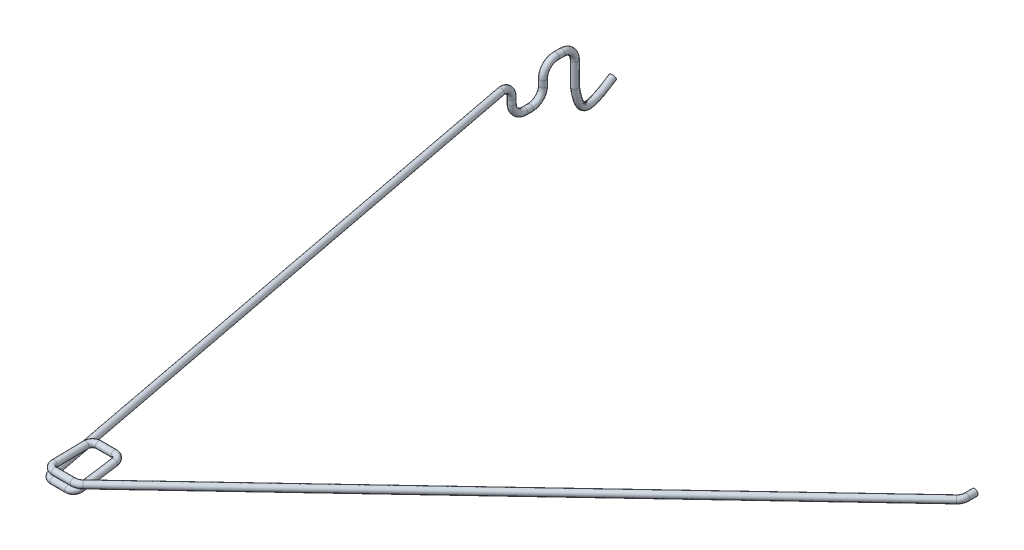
ISO-10303-21;
HEADER;
FILE_DESCRIPTION(('STEP AP214'),'2;1');
FILE_NAME('part.step','',(''),(''),'','','');
FILE_SCHEMA(('AUTOMOTIVE_DESIGN { 1 0 10303 214 1 1 1 1 }'));
ENDSEC;
DATA;
#1=APPLICATION_CONTEXT('core data for automotive mechanical design processes');
#2=APPLICATION_PROTOCOL_DEFINITION('international standard','automotive_design',2000,#1);
#3=PRODUCT_CONTEXT('',#1,'mechanical');
#4=PRODUCT('Part','Part','',(#3));
#5=PRODUCT_RELATED_PRODUCT_CATEGORY('part','',(#4));
#6=PRODUCT_DEFINITION_FORMATION('','',#4);
#7=PRODUCT_DEFINITION_CONTEXT('part definition',#1,'design');
#8=PRODUCT_DEFINITION('design','',#6,#7);
#9=PRODUCT_DEFINITION_SHAPE('','',#8);
#10=(LENGTH_UNIT() NAMED_UNIT(*) SI_UNIT(.MILLI.,.METRE.));
#11=(NAMED_UNIT(*) PLANE_ANGLE_UNIT() SI_UNIT($,.RADIAN.));
#12=(NAMED_UNIT(*) SI_UNIT($,.STERADIAN.) SOLID_ANGLE_UNIT());
#13=UNCERTAINTY_MEASURE_WITH_UNIT(LENGTH_MEASURE(1.E-05),#10,'distance_accuracy_value','');
#14=(GEOMETRIC_REPRESENTATION_CONTEXT(3) GLOBAL_UNCERTAINTY_ASSIGNED_CONTEXT((#13)) GLOBAL_UNIT_ASSIGNED_CONTEXT((#10,
#11,#12)) REPRESENTATION_CONTEXT('',''));
#15=CARTESIAN_POINT('',(0.,0.,0.));
#16=DIRECTION('',(0.,0.,1.));
#17=DIRECTION('',(1.,0.,0.));
#18=AXIS2_PLACEMENT_3D('',#15,#16,#17);
#19=CARTESIAN_POINT('',(-264.839690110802,36.7880776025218,54.3321516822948));
#20=DIRECTION('',(0.,-1.,0.));
#21=DIRECTION('',(0.,0.,-1.));
#22=AXIS2_PLACEMENT_3D('',#19,#20,#21);
#23=CYLINDRICAL_SURFACE('',#22,0.999999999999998);
#24=CARTESIAN_POINT('',(-264.839690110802,36.7880776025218,54.3321516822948));
#25=DIRECTION('',(0.,-1.,0.));
#26=DIRECTION('',(-0.921185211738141,0.,0.389124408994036));
#27=AXIS2_PLACEMENT_3D('',#24,#25,#26);
#28=CIRCLE('',#27,0.999999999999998);
#29=CARTESIAN_POINT('',(-264.839690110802,36.7880776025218,53.3321516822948));
#30=VERTEX_POINT('',#29);
#31=EDGE_CURVE('E11',#30,#30,#28,.T.);
#32=ORIENTED_EDGE('',*,*,#31,.T.);
#33=EDGE_LOOP('',(#32));
#34=FACE_BOUND('',#33,.T.);
#35=CARTESIAN_POINT('',(-265.00234133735,29.5658940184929,55.3188353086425));
#36=CARTESIAN_POINT('',(-263.028974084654,29.5658940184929,55.6441377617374));
#37=CARTESIAN_POINT('',(-262.70367163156,29.7388210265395,53.670770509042));
#38=CARTESIAN_POINT('',(-264.677038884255,29.7388210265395,53.3454680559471));
#39=CARTESIAN_POINT('',(-266.65040613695,29.7388210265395,53.0201656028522));
#40=CARTESIAN_POINT('',(-266.975708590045,29.5658940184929,54.9935328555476));
#41=CARTESIAN_POINT('',(-265.00234133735,29.5658940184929,55.3188353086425));
#42=(BOUNDED_CURVE() B_SPLINE_CURVE(3,(#35,#36,#37,#38,#39,#40,#41),.UNSPECIFIED.,.T.,
.F.) B_SPLINE_CURVE_WITH_KNOTS((4,3,4),(0.,0.5,1.),
.UNSPECIFIED.) CURVE() GEOMETRIC_REPRESENTATION_ITEM() RATIONAL_B_SPLINE_CURVE((1.,
0.333333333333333,0.333333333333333,1.,0.333333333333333,0.333333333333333,1.)) REPRESENTATION_ITEM(''));
#43=CARTESIAN_POINT('',(-265.00234133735,29.5658940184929,55.3188353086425));
#44=VERTEX_POINT('',#43);
#45=EDGE_CURVE('E110',#44,#44,#42,.T.);
#46=ORIENTED_EDGE('',*,*,#45,.T.);
#47=EDGE_LOOP('',(#46));
#48=FACE_BOUND('',#47,.T.);
#49=ADVANCED_FACE('F25',(#34,#48),#23,.T.);
#50=CARTESIAN_POINT('',(-264.839690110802,36.7880776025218,58.3321516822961));
#51=DIRECTION('',(-1.,0.,0.));
#52=DIRECTION('',(0.,0.,1.));
#53=AXIS2_PLACEMENT_3D('',#50,#51,#52);
#54=TOROIDAL_SURFACE('',#53,4.00000000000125,0.999999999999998);
#55=CARTESIAN_POINT('',(-264.839690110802,40.7880776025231,58.332151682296));
#56=DIRECTION('',(0.,0.,-1.));
#57=DIRECTION('',(-0.921185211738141,-0.389124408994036,0.));
#58=AXIS2_PLACEMENT_3D('',#55,#56,#57);
#59=CIRCLE('',#58,0.999999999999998);
#60=CARTESIAN_POINT('',(-264.839690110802,41.7880776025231,58.332151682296));
#61=VERTEX_POINT('',#60);
#62=EDGE_CURVE('E31',#61,#61,#59,.T.);
#63=CARTESIAN_POINT('',(-264.839690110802,36.7880776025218,58.3321516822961));
#64=DIRECTION('',(-1.,0.,0.));
#65=DIRECTION('',(0.,0.,1.));
#66=AXIS2_PLACEMENT_3D('',#63,#64,#65);
#67=CIRCLE('',#66,5.00000000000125);
#68=EDGE_CURVE('',#61,#30,#67,.T.);
#69=ORIENTED_EDGE('',*,*,#62,.T.);
#70=ORIENTED_EDGE('',*,*,#31,.F.);
#71=ORIENTED_EDGE('',*,*,#68,.T.);
#72=ORIENTED_EDGE('',*,*,#68,.F.);
#73=EDGE_LOOP('',(#69,#71,#70,#72));
#74=FACE_BOUND('',#73,.T.);
#75=ADVANCED_FACE('F137',(#74),#54,.T.);
#76=CARTESIAN_POINT('',(-264.839690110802,40.7880776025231,60.1683467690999));
#77=DIRECTION('',(0.,0.,-1.));
#78=DIRECTION('',(0.,1.,0.));
#79=AXIS2_PLACEMENT_3D('',#76,#77,#78);
#80=CYLINDRICAL_SURFACE('',#79,0.999999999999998);
#81=CARTESIAN_POINT('',(-264.839690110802,40.7880776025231,60.1683467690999));
#82=DIRECTION('',(0.,0.,-1.));
#83=DIRECTION('',(-0.921185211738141,-0.389124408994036,0.));
#84=AXIS2_PLACEMENT_3D('',#81,#82,#83);
#85=CIRCLE('',#84,0.999999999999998);
#86=CARTESIAN_POINT('',(-264.839690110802,41.7880776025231,60.1683467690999));
#87=VERTEX_POINT('',#86);
#88=EDGE_CURVE('E35',#87,#87,#85,.T.);
#89=ORIENTED_EDGE('',*,*,#88,.T.);
#90=EDGE_LOOP('',(#89));
#91=FACE_BOUND('',#90,.T.);
#92=ORIENTED_EDGE('',*,*,#62,.F.);
#93=EDGE_LOOP('',(#92));
#94=FACE_BOUND('',#93,.T.);
#95=ADVANCED_FACE('F141',(#91,#94),#80,.T.);
#96=CARTESIAN_POINT('',(-264.839690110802,36.7880776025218,60.1683467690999));
#97=DIRECTION('',(-1.,0.,0.));
#98=DIRECTION('',(0.,0.,1.));
#99=AXIS2_PLACEMENT_3D('',#96,#97,#98);
#100=TOROIDAL_SURFACE('',#99,4.00000000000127,0.999999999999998);
#101=CARTESIAN_POINT('',(-264.839690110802,36.7880776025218,64.1683467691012));
#102=DIRECTION('',(0.,1.,0.));
#103=DIRECTION('',(-0.921185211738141,0.,-0.389124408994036));
#104=AXIS2_PLACEMENT_3D('',#101,#102,#103);
#105=CIRCLE('',#104,0.999999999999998);
#106=CARTESIAN_POINT('',(-264.839690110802,36.7880776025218,65.1683467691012));
#107=VERTEX_POINT('',#106);
#108=EDGE_CURVE('E39',#107,#107,#105,.T.);
#109=CARTESIAN_POINT('',(-264.839690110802,36.7880776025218,60.1683467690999));
#110=DIRECTION('',(-1.,0.,0.));
#111=DIRECTION('',(0.,0.,1.));
#112=AXIS2_PLACEMENT_3D('',#109,#110,#111);
#113=CIRCLE('',#112,5.00000000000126);
#114=EDGE_CURVE('',#107,#87,#113,.T.);
#115=ORIENTED_EDGE('',*,*,#108,.T.);
#116=ORIENTED_EDGE('',*,*,#88,.F.);
#117=ORIENTED_EDGE('',*,*,#114,.T.);
#118=ORIENTED_EDGE('',*,*,#114,.F.);
#119=EDGE_LOOP('',(#115,#117,#116,#118));
#120=FACE_BOUND('',#119,.T.);
#121=ADVANCED_FACE('F145',(#120),#100,.T.);
#122=CARTESIAN_POINT('',(-264.839690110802,34.8914459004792,64.1683467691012));
#123=DIRECTION('',(0.,1.,0.));
#124=DIRECTION('',(0.,0.,1.));
#125=AXIS2_PLACEMENT_3D('',#122,#123,#124);
#126=CYLINDRICAL_SURFACE('',#125,0.999999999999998);
#127=CARTESIAN_POINT('',(-264.839690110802,34.8914459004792,64.1683467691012));
#128=DIRECTION('',(0.,1.,0.));
#129=DIRECTION('',(-0.921185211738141,0.,-0.389124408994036));
#130=AXIS2_PLACEMENT_3D('',#127,#128,#129);
#131=CIRCLE('',#130,0.999999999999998);
#132=CARTESIAN_POINT('',(-264.839690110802,34.8914459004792,63.1683467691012));
#133=VERTEX_POINT('',#132);
#134=EDGE_CURVE('E44',#133,#133,#131,.T.);
#135=ORIENTED_EDGE('',*,*,#134,.T.);
#136=EDGE_LOOP('',(#135));
#137=FACE_BOUND('',#136,.T.);
#138=ORIENTED_EDGE('',*,*,#108,.F.);
#139=EDGE_LOOP('',(#138));
#140=FACE_BOUND('',#139,.T.);
#141=ADVANCED_FACE('F152',(#137,#140),#126,.T.);
#142=CARTESIAN_POINT('',(-264.839690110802,34.8914459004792,68.1683467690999));
#143=DIRECTION('',(1.,0.,0.));
#144=DIRECTION('',(0.,0.,-1.));
#145=AXIS2_PLACEMENT_3D('',#142,#143,#144);
#146=TOROIDAL_SURFACE('',#145,3.99999999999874,0.999999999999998);
#147=CARTESIAN_POINT('',(-264.839690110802,30.8914459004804,68.1683467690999));
#148=DIRECTION('',(0.,0.,-1.));
#149=DIRECTION('',(-0.921185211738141,-0.389124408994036,0.));
#150=AXIS2_PLACEMENT_3D('',#147,#148,#149);
#151=CIRCLE('',#150,0.999999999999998);
#152=CARTESIAN_POINT('',(-264.839690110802,29.8914459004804,68.1683467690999));
#153=VERTEX_POINT('',#152);
#154=EDGE_CURVE('E47',#153,#153,#151,.T.);
#155=CARTESIAN_POINT('',(-264.839690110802,34.8914459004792,68.1683467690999));
#156=DIRECTION('',(1.,0.,0.));
#157=DIRECTION('',(0.,0.,-1.));
#158=AXIS2_PLACEMENT_3D('',#155,#156,#157);
#159=CIRCLE('',#158,4.99999999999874);
#160=EDGE_CURVE('',#153,#133,#159,.T.);
#161=ORIENTED_EDGE('',*,*,#154,.T.);
#162=ORIENTED_EDGE('',*,*,#134,.F.);
#163=ORIENTED_EDGE('',*,*,#160,.T.);
#164=ORIENTED_EDGE('',*,*,#160,.F.);
#165=EDGE_LOOP('',(#161,#163,#162,#164));
#166=FACE_BOUND('',#165,.T.);
#167=ADVANCED_FACE('F156',(#166),#146,.T.);
#168=CARTESIAN_POINT('',(-264.839690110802,30.8914459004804,69.86920921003));
#169=DIRECTION('',(0.,0.,-1.));
#170=DIRECTION('',(0.,1.,0.));
#171=AXIS2_PLACEMENT_3D('',#168,#169,#170);
#172=CYLINDRICAL_SURFACE('',#171,0.999999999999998);
#173=CARTESIAN_POINT('',(-264.839690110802,30.8914459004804,69.86920921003));
#174=DIRECTION('',(0.,0.,-1.));
#175=DIRECTION('',(-0.921185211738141,-0.389124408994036,0.));
#176=AXIS2_PLACEMENT_3D('',#173,#174,#175);
#177=CIRCLE('',#176,0.999999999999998);
#178=CARTESIAN_POINT('',(-264.839690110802,29.8914459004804,69.86920921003));
#179=VERTEX_POINT('',#178);
#180=EDGE_CURVE('E50',#179,#179,#177,.T.);
#181=ORIENTED_EDGE('',*,*,#180,.T.);
#182=EDGE_LOOP('',(#181));
#183=FACE_BOUND('',#182,.T.);
#184=ORIENTED_EDGE('',*,*,#154,.F.);
#185=EDGE_LOOP('',(#184));
#186=FACE_BOUND('',#185,.T.);
#187=ADVANCED_FACE('F160',(#183,#186),#172,.T.);
#188=CARTESIAN_POINT('',(-264.839690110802,34.8914459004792,69.8692092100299));
#189=DIRECTION('',(1.,0.,0.));
#190=DIRECTION('',(0.,0.,-1.));
#191=AXIS2_PLACEMENT_3D('',#188,#189,#190);
#192=TOROIDAL_SURFACE('',#191,3.99999999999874,0.999999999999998);
#193=CARTESIAN_POINT('',(-264.839690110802,34.8914459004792,73.8692092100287));
#194=DIRECTION('',(0.,-1.,0.));
#195=DIRECTION('',(-0.921185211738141,0.,0.389124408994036));
#196=AXIS2_PLACEMENT_3D('',#193,#194,#195);
#197=CIRCLE('',#196,0.999999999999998);
#198=CARTESIAN_POINT('',(-264.839690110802,34.8914459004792,74.8692092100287));
#199=VERTEX_POINT('',#198);
#200=EDGE_CURVE('E53',#199,#199,#197,.T.);
#201=CARTESIAN_POINT('',(-264.839690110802,34.8914459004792,69.8692092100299));
#202=DIRECTION('',(1.,0.,0.));
#203=DIRECTION('',(0.,0.,-1.));
#204=AXIS2_PLACEMENT_3D('',#201,#202,#203);
#205=CIRCLE('',#204,4.99999999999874);
#206=EDGE_CURVE('',#199,#179,#205,.T.);
#207=ORIENTED_EDGE('',*,*,#200,.T.);
#208=ORIENTED_EDGE('',*,*,#180,.F.);
#209=ORIENTED_EDGE('',*,*,#206,.T.);
#210=ORIENTED_EDGE('',*,*,#206,.F.);
#211=EDGE_LOOP('',(#207,#209,#208,#210));
#212=FACE_BOUND('',#211,.T.);
#213=ADVANCED_FACE('F164',(#212),#192,.T.);
#214=CARTESIAN_POINT('',(-264.839690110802,36.3958685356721,73.8692092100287));
#215=DIRECTION('',(0.,-1.,0.));
#216=DIRECTION('',(0.,0.,-1.));
#217=AXIS2_PLACEMENT_3D('',#214,#215,#216);
#218=CYLINDRICAL_SURFACE('',#217,0.999999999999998);
#219=CARTESIAN_POINT('',(-264.839690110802,36.3958685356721,73.8692092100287));
#220=DIRECTION('',(0.,-1.,0.));
#221=DIRECTION('',(-0.921185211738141,0.,0.389124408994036));
#222=AXIS2_PLACEMENT_3D('',#219,#220,#221);
#223=CIRCLE('',#222,0.999999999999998);
#224=CARTESIAN_POINT('',(-265.003293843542,36.3958685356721,72.8826830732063));
#225=VERTEX_POINT('',#224);
#226=EDGE_CURVE('E56',#225,#225,#223,.T.);
#227=ORIENTED_EDGE('',*,*,#226,.T.);
#228=EDGE_LOOP('',(#227));
#229=FACE_BOUND('',#228,.T.);
#230=ORIENTED_EDGE('',*,*,#200,.F.);
#231=EDGE_LOOP('',(#230));
#232=FACE_BOUND('',#231,.T.);
#233=ADVANCED_FACE('F168',(#229,#232),#218,.T.);
#234=CARTESIAN_POINT('',(-264.185275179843,36.3958685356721,77.8153137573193));
#235=DIRECTION('',(-0.986526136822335,0.,0.163603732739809));
#236=DIRECTION('',(0.163603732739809,0.,0.986526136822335));
#237=AXIS2_PLACEMENT_3D('',#234,#235,#236);
#238=TOROIDAL_SURFACE('',#237,4.00000000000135,0.999999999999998);
#239=CARTESIAN_POINT('',(-264.164783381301,40.3939070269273,77.9388787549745));
#240=DIRECTION('',(-0.163523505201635,0.0313131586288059,-0.986042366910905));
#241=DIRECTION('',(-0.960527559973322,-0.233057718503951,0.15189110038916));
#242=AXIS2_PLACEMENT_3D('',#239,#240,#241);
#243=CIRCLE('',#242,0.999999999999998);
#244=CARTESIAN_POINT('',(-264.159660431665,41.3934166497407,77.9697700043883));
#245=VERTEX_POINT('',#244);
#246=EDGE_CURVE('E59',#245,#245,#243,.T.);
#247=CARTESIAN_POINT('',(-264.185275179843,36.3958685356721,77.8153137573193));
#248=DIRECTION('',(-0.986526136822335,0.,0.163603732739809));
#249=DIRECTION('',(0.163603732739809,0.,0.986526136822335));
#250=AXIS2_PLACEMENT_3D('',#247,#248,#249);
#251=CIRCLE('',#250,5.00000000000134);
#252=EDGE_CURVE('',#245,#225,#251,.T.);
#253=ORIENTED_EDGE('',*,*,#246,.T.);
#254=ORIENTED_EDGE('',*,*,#226,.F.);
#255=ORIENTED_EDGE('',*,*,#252,.T.);
#256=ORIENTED_EDGE('',*,*,#252,.F.);
#257=EDGE_LOOP('',(#253,#255,#254,#256));
#258=FACE_BOUND('',#257,.T.);
#259=ADVANCED_FACE('F172',(#258),#238,.T.);
#260=CARTESIAN_POINT('',(-236.58079992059,35.1118428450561,244.269561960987));
#261=DIRECTION('',(-0.163523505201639,0.0313131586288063,-0.986042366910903));
#262=DIRECTION('',(-0.986526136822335,0.,0.163603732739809));
#263=AXIS2_PLACEMENT_3D('',#260,#261,#262);
#264=CYLINDRICAL_SURFACE('',#263,0.999999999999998);
#265=CARTESIAN_POINT('',(-236.58079992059,35.1118428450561,244.269561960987));
#266=DIRECTION('',(-0.163523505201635,0.0313131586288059,-0.986042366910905));
#267=DIRECTION('',(-0.960527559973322,-0.233057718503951,0.15189110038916));
#268=AXIS2_PLACEMENT_3D('',#265,#266,#267);
#269=CIRCLE('',#268,0.999999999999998);
#270=CARTESIAN_POINT('',(-237.567339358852,35.1066525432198,244.433003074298));
#271=VERTEX_POINT('',#270);
#272=EDGE_CURVE('E62',#271,#271,#269,.T.);
#273=ORIENTED_EDGE('',*,*,#272,.T.);
#274=EDGE_LOOP('',(#273));
#275=FACE_BOUND('',#274,.T.);
#276=ORIENTED_EDGE('',*,*,#246,.F.);
#277=EDGE_LOOP('',(#276));
#278=FACE_BOUND('',#277,.T.);
#279=ADVANCED_FACE('F176',(#275,#278),#264,.T.);
#280=CARTESIAN_POINT('',(-234.607721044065,35.1222234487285,243.942679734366));
#281=DIRECTION('',(0.,-0.999496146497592,-0.0317404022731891));
#282=DIRECTION('',(0.,0.0317404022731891,-0.999496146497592));
#283=AXIS2_PLACEMENT_3D('',#280,#281,#282);
#284=TOROIDAL_SURFACE('',#283,2.00000000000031,0.999999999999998);
#285=CARTESIAN_POINT('',(-234.607721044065,35.0587426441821,245.941672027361));
#286=DIRECTION('',(-1.,0.,0.));
#287=DIRECTION('',(0.,-0.258907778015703,0.965902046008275));
#288=AXIS2_PLACEMENT_3D('',#285,#286,#287);
#289=CIRCLE('',#288,0.999999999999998);
#290=CARTESIAN_POINT('',(-234.607721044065,35.0270022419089,246.941168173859));
#291=VERTEX_POINT('',#290);
#292=EDGE_CURVE('E65',#291,#291,#289,.T.);
#293=CARTESIAN_POINT('',(-234.607721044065,35.1222234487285,243.942679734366));
#294=DIRECTION('',(0.,-0.999496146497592,-0.0317404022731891));
#295=DIRECTION('',(0.,0.0317404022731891,-0.999496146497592));
#296=AXIS2_PLACEMENT_3D('',#293,#294,#295);
#297=CIRCLE('',#296,3.00000000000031);
#298=EDGE_CURVE('',#291,#271,#297,.T.);
#299=ORIENTED_EDGE('',*,*,#292,.T.);
#300=ORIENTED_EDGE('',*,*,#272,.F.);
#301=ORIENTED_EDGE('',*,*,#298,.T.);
#302=ORIENTED_EDGE('',*,*,#298,.F.);
#303=EDGE_LOOP('',(#299,#301,#300,#302));
#304=FACE_BOUND('',#303,.T.);
#305=ADVANCED_FACE('F180',(#304),#284,.T.);
#306=CARTESIAN_POINT('',(-230.075091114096,35.058742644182,245.941672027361));
#307=DIRECTION('',(-1.,0.,0.));
#308=DIRECTION('',(0.,-1.,0.));
#309=AXIS2_PLACEMENT_3D('',#306,#307,#308);
#310=CYLINDRICAL_SURFACE('',#309,0.999999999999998);
#311=CARTESIAN_POINT('',(-230.075091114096,35.058742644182,245.941672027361));
#312=DIRECTION('',(-1.,0.,0.));
#313=DIRECTION('',(0.,-0.258907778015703,0.965902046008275));
#314=AXIS2_PLACEMENT_3D('',#311,#312,#313);
#315=CIRCLE('',#314,0.999999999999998);
#316=CARTESIAN_POINT('',(-230.075091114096,34.9049249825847,246.929771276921));
#317=VERTEX_POINT('',#316);
#318=EDGE_CURVE('E68',#317,#317,#315,.T.);
#319=ORIENTED_EDGE('',*,*,#318,.T.);
#320=EDGE_LOOP('',(#319));
#321=FACE_BOUND('',#320,.T.);
#322=ORIENTED_EDGE('',*,*,#292,.F.);
#323=EDGE_LOOP('',(#322));
#324=FACE_BOUND('',#323,.T.);
#325=ADVANCED_FACE('F184',(#321,#324),#310,.T.);
#326=CARTESIAN_POINT('',(-230.075091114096,35.3663779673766,243.965473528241));
#327=DIRECTION('',(0.,-0.988099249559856,-0.153817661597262));
#328=DIRECTION('',(0.,0.153817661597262,-0.988099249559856));
#329=AXIS2_PLACEMENT_3D('',#326,#327,#328);
#330=TOROIDAL_SURFACE('',#329,2.00000000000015,0.999999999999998);
#331=CARTESIAN_POINT('',(-228.075094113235,35.3658452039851,243.968895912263));
#332=DIRECTION('',(-0.00173180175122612,-0.153817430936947,0.988097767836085));
#333=DIRECTION('',(0.994230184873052,-0.106242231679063,-0.0147962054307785));
#334=AXIS2_PLACEMENT_3D('',#331,#332,#333);
#335=CIRCLE('',#334,0.999999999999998);
#336=CARTESIAN_POINT('',(-227.075095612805,35.3655788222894,243.970607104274));
#337=VERTEX_POINT('',#336);
#338=EDGE_CURVE('E71',#337,#337,#335,.T.);
#339=CARTESIAN_POINT('',(-230.075091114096,35.3663779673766,243.965473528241));
#340=DIRECTION('',(0.,-0.988099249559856,-0.153817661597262));
#341=DIRECTION('',(0.,0.153817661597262,-0.988099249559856));
#342=AXIS2_PLACEMENT_3D('',#339,#340,#341);
#343=CIRCLE('',#342,3.00000000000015);
#344=EDGE_CURVE('',#337,#317,#343,.T.);
#345=ORIENTED_EDGE('',*,*,#338,.T.);
#346=ORIENTED_EDGE('',*,*,#318,.F.);
#347=ORIENTED_EDGE('',*,*,#344,.T.);
#348=ORIENTED_EDGE('',*,*,#344,.F.);
#349=EDGE_LOOP('',(#345,#347,#346,#348));
#350=FACE_BOUND('',#349,.T.);
#351=ADVANCED_FACE('F188',(#350),#330,.T.);
#352=CARTESIAN_POINT('',(-228.056892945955,36.9824602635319,233.584027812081));
#353=DIRECTION('',(-0.00173180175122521,-0.153817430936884,0.988097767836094));
#354=DIRECTION('',(0.,-0.988099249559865,-0.1538176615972));
#355=AXIS2_PLACEMENT_3D('',#352,#353,#354);
#356=CYLINDRICAL_SURFACE('',#355,0.999999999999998);
#357=CARTESIAN_POINT('',(-228.056892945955,36.9824602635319,233.584027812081));
#358=DIRECTION('',(-0.00173180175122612,-0.153817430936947,0.988097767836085));
#359=DIRECTION('',(0.994230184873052,-0.106242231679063,-0.0147962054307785));
#360=AXIS2_PLACEMENT_3D('',#357,#358,#359);
#361=CIRCLE('',#360,0.999999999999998);
#362=CARTESIAN_POINT('',(-227.056894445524,36.9821938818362,233.585739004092));
#363=VERTEX_POINT('',#362);
#364=EDGE_CURVE('E74',#363,#363,#361,.T.);
#365=ORIENTED_EDGE('',*,*,#364,.T.);
#366=EDGE_LOOP('',(#365));
#367=FACE_BOUND('',#366,.T.);
#368=ORIENTED_EDGE('',*,*,#338,.F.);
#369=EDGE_LOOP('',(#368));
#370=FACE_BOUND('',#369,.T.);
#371=ADVANCED_FACE('F192',(#367,#370),#356,.T.);
#372=CARTESIAN_POINT('',(-230.056889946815,36.9829930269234,233.580605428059));
#373=DIRECTION('',(0.,-0.988099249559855,-0.153817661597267));
#374=DIRECTION('',(0.,0.153817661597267,-0.988099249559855));
#375=AXIS2_PLACEMENT_3D('',#372,#373,#374);
#376=TOROIDAL_SURFACE('',#375,2.00000000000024,0.999999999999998);
#377=CARTESIAN_POINT('',(-230.056889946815,37.290628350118,231.604406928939));
#378=DIRECTION('',(1.,0.,0.));
#379=DIRECTION('',(0.,0.0469530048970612,-0.99889709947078));
#380=AXIS2_PLACEMENT_3D('',#377,#378,#379);
#381=CIRCLE('',#380,0.999999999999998);
#382=CARTESIAN_POINT('',(-230.056889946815,37.4444460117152,230.616307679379));
#383=VERTEX_POINT('',#382);
#384=EDGE_CURVE('E77',#383,#383,#381,.T.);
#385=CARTESIAN_POINT('',(-230.056889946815,36.9829930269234,233.580605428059));
#386=DIRECTION('',(0.,-0.988099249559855,-0.153817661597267));
#387=DIRECTION('',(0.,0.153817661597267,-0.988099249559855));
#388=AXIS2_PLACEMENT_3D('',#385,#386,#387);
#389=CIRCLE('',#388,3.00000000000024);
#390=EDGE_CURVE('',#383,#363,#389,.T.);
#391=ORIENTED_EDGE('',*,*,#384,.T.);
#392=ORIENTED_EDGE('',*,*,#364,.F.);
#393=ORIENTED_EDGE('',*,*,#390,.T.);
#394=ORIENTED_EDGE('',*,*,#390,.F.);
#395=EDGE_LOOP('',(#391,#393,#392,#394));
#396=FACE_BOUND('',#395,.T.);
#397=ADVANCED_FACE('F196',(#396),#376,.T.);
#398=CARTESIAN_POINT('',(-234.873906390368,37.2906283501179,231.604406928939));
#399=DIRECTION('',(1.,0.,0.));
#400=DIRECTION('',(0.,1.,0.));
#401=AXIS2_PLACEMENT_3D('',#398,#399,#400);
#402=CYLINDRICAL_SURFACE('',#401,0.999999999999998);
#403=CARTESIAN_POINT('',(-234.873906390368,37.2906283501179,231.604406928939));
#404=DIRECTION('',(1.,0.,0.));
#405=DIRECTION('',(0.,0.0469530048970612,-0.99889709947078));
#406=AXIS2_PLACEMENT_3D('',#403,#404,#405);
#407=CIRCLE('',#406,0.999999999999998);
#408=CARTESIAN_POINT('',(-234.873906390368,37.3094811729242,230.604584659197));
#409=VERTEX_POINT('',#408);
#410=EDGE_CURVE('E80',#409,#409,#407,.T.);
#411=ORIENTED_EDGE('',*,*,#410,.T.);
#412=EDGE_LOOP('',(#411));
#413=FACE_BOUND('',#412,.T.);
#414=ORIENTED_EDGE('',*,*,#384,.F.);
#415=EDGE_LOOP('',(#414));
#416=FACE_BOUND('',#415,.T.);
#417=ADVANCED_FACE('F200',(#413,#416),#402,.T.);
#418=CARTESIAN_POINT('',(-234.873906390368,37.2529227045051,233.604051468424));
#419=DIRECTION('',(0.,-0.999822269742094,-0.0188528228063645));
#420=DIRECTION('',(0.,0.0188528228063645,-0.999822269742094));
#421=AXIS2_PLACEMENT_3D('',#418,#419,#420);
#422=TOROIDAL_SURFACE('',#421,2.,0.999999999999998);
#423=CARTESIAN_POINT('',(-236.873906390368,37.2529227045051,233.604051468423));
#424=DIRECTION('',(0.,0.0188528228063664,-0.999822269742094));
#425=DIRECTION('',(-0.999604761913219,0.0281076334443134,0.000530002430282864));
#426=AXIS2_PLACEMENT_3D('',#423,#424,#425);
#427=CIRCLE('',#426,0.999999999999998);
#428=CARTESIAN_POINT('',(-237.873906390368,37.2529227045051,233.604051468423));
#429=VERTEX_POINT('',#428);
#430=EDGE_CURVE('E83',#429,#429,#427,.T.);
#431=CARTESIAN_POINT('',(-234.873906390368,37.2529227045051,233.604051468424));
#432=DIRECTION('',(0.,-0.999822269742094,-0.0188528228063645));
#433=DIRECTION('',(0.,0.0188528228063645,-0.999822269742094));
#434=AXIS2_PLACEMENT_3D('',#431,#432,#433);
#435=CIRCLE('',#434,3.);
#436=EDGE_CURVE('',#429,#409,#435,.T.);
#437=ORIENTED_EDGE('',*,*,#430,.T.);
#438=ORIENTED_EDGE('',*,*,#410,.F.);
#439=ORIENTED_EDGE('',*,*,#436,.T.);
#440=ORIENTED_EDGE('',*,*,#436,.F.);
#441=EDGE_LOOP('',(#437,#439,#438,#440));
#442=FACE_BOUND('',#441,.T.);
#443=ADVANCED_FACE('F204',(#442),#422,.T.);
#444=CARTESIAN_POINT('',(-236.873906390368,37.0703909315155,243.284263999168));
#445=DIRECTION('',(0.,0.0188528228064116,-0.999822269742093));
#446=DIRECTION('',(0.,0.999822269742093,0.0188528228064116));
#447=AXIS2_PLACEMENT_3D('',#444,#445,#446);
#448=CYLINDRICAL_SURFACE('',#447,0.999999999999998);
#449=CARTESIAN_POINT('',(-236.873906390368,37.0703909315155,243.284263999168));
#450=DIRECTION('',(0.,0.0188528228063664,-0.999822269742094));
#451=DIRECTION('',(-0.999604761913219,0.0281076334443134,0.000530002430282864));
#452=AXIS2_PLACEMENT_3D('',#449,#450,#451);
#453=CIRCLE('',#452,0.999999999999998);
#454=CARTESIAN_POINT('',(-237.873906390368,37.0703909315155,243.284263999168));
#455=VERTEX_POINT('',#454);
#456=EDGE_CURVE('E86',#455,#455,#453,.T.);
#457=ORIENTED_EDGE('',*,*,#456,.T.);
#458=EDGE_LOOP('',(#457));
#459=FACE_BOUND('',#458,.T.);
#460=ORIENTED_EDGE('',*,*,#430,.F.);
#461=EDGE_LOOP('',(#460));
#462=FACE_BOUND('',#461,.T.);
#463=ADVANCED_FACE('F208',(#459,#462),#448,.T.);
#464=CARTESIAN_POINT('',(-234.873906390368,37.0703909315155,243.284263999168));
#465=DIRECTION('',(0.,-0.999822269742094,-0.0188528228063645));
#466=DIRECTION('',(0.,0.0188528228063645,-0.999822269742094));
#467=AXIS2_PLACEMENT_3D('',#464,#465,#466);
#468=TOROIDAL_SURFACE('',#467,1.99999999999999,0.999999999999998);
#469=CARTESIAN_POINT('',(-234.873906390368,37.0326852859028,245.283908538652));
#470=DIRECTION('',(-1.,0.,0.));
#471=DIRECTION('',(0.,0.00926226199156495,0.999957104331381));
#472=AXIS2_PLACEMENT_3D('',#469,#470,#471);
#473=CIRCLE('',#472,0.999999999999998);
#474=CARTESIAN_POINT('',(-234.873906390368,37.0138324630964,246.283730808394));
#475=VERTEX_POINT('',#474);
#476=EDGE_CURVE('E89',#475,#475,#473,.T.);
#477=CARTESIAN_POINT('',(-234.873906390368,37.0703909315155,243.284263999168));
#478=DIRECTION('',(0.,-0.999822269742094,-0.0188528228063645));
#479=DIRECTION('',(0.,0.0188528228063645,-0.999822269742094));
#480=AXIS2_PLACEMENT_3D('',#477,#478,#479);
#481=CIRCLE('',#480,2.99999999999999);
#482=EDGE_CURVE('',#475,#455,#481,.T.);
#483=ORIENTED_EDGE('',*,*,#476,.T.);
#484=ORIENTED_EDGE('',*,*,#456,.F.);
#485=ORIENTED_EDGE('',*,*,#482,.T.);
#486=ORIENTED_EDGE('',*,*,#482,.F.);
#487=EDGE_LOOP('',(#483,#485,#484,#486));
#488=FACE_BOUND('',#487,.T.);
#489=ADVANCED_FACE('F212',(#488),#468,.T.);
#490=CARTESIAN_POINT('',(-229.053961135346,37.0326852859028,245.283908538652));
#491=DIRECTION('',(-1.,0.,0.));
#492=DIRECTION('',(0.,0.,1.));
#493=AXIS2_PLACEMENT_3D('',#490,#491,#492);
#494=CYLINDRICAL_SURFACE('',#493,0.999999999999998);
#495=CARTESIAN_POINT('',(-229.053961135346,37.0326852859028,245.283908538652));
#496=DIRECTION('',(-1.,0.,0.));
#497=DIRECTION('',(0.,0.00926226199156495,0.999957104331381));
#498=AXIS2_PLACEMENT_3D('',#495,#496,#497);
#499=CIRCLE('',#498,0.999999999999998);
#500=CARTESIAN_POINT('',(-229.053961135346,37.0487192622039,246.283779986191));
#501=VERTEX_POINT('',#500);
#502=EDGE_CURVE('E92',#501,#501,#499,.T.);
#503=ORIENTED_EDGE('',*,*,#502,.T.);
#504=EDGE_LOOP('',(#503));
#505=FACE_BOUND('',#504,.T.);
#506=ORIENTED_EDGE('',*,*,#476,.F.);
#507=EDGE_LOOP('',(#506));
#508=FACE_BOUND('',#507,.T.);
#509=ADVANCED_FACE('F216',(#505,#508),#494,.T.);
#510=CARTESIAN_POINT('',(-229.053961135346,36.9845833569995,242.284294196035));
#511=DIRECTION('',(0.,-0.99987144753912,0.0160339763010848));
#512=DIRECTION('',(0.,-0.0160339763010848,-0.99987144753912));
#513=AXIS2_PLACEMENT_3D('',#510,#511,#512);
#514=TOROIDAL_SURFACE('',#513,3.00000000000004,0.999999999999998);
#515=CARTESIAN_POINT('',(-226.96220239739,37.0190640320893,244.434493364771));
#516=DIRECTION('',(-0.716825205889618,0.0111797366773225,0.697163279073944));
#517=DIRECTION('',(0.697236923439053,0.00472194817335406,0.716825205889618));
#518=AXIS2_PLACEMENT_3D('',#515,#516,#517);
#519=CIRCLE('',#518,0.999999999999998);
#520=CARTESIAN_POINT('',(-226.264949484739,37.0305575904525,245.151226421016));
#521=VERTEX_POINT('',#520);
#522=EDGE_CURVE('E95',#521,#521,#519,.T.);
#523=CARTESIAN_POINT('',(-229.053961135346,36.9845833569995,242.284294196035));
#524=DIRECTION('',(0.,-0.99987144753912,0.0160339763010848));
#525=DIRECTION('',(0.,-0.0160339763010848,-0.99987144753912));
#526=AXIS2_PLACEMENT_3D('',#523,#524,#525);
#527=CIRCLE('',#526,4.00000000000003);
#528=EDGE_CURVE('',#521,#501,#527,.T.);
#529=ORIENTED_EDGE('',*,*,#522,.T.);
#530=ORIENTED_EDGE('',*,*,#502,.F.);
#531=ORIENTED_EDGE('',*,*,#528,.T.);
#532=ORIENTED_EDGE('',*,*,#528,.F.);
#533=EDGE_LOOP('',(#529,#531,#530,#532));
#534=FACE_BOUND('',#533,.T.);
#535=ADVANCED_FACE('F220',(#534),#514,.T.);
#536=CARTESIAN_POINT('',(-89.9098083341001,34.8815698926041,111.141333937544));
#537=DIRECTION('',(-0.71682520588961,0.011179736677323,0.69716327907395));
#538=DIRECTION('',(0.697206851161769,0.,0.716870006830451));
#539=AXIS2_PLACEMENT_3D('',#536,#537,#538);
#540=CYLINDRICAL_SURFACE('',#539,0.999999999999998);
#541=CARTESIAN_POINT('',(-89.9098083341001,34.8815698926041,111.141333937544));
#542=DIRECTION('',(-0.716825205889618,0.0111797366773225,0.697163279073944));
#543=DIRECTION('',(0.697236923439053,0.00472194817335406,0.716825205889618));
#544=AXIS2_PLACEMENT_3D('',#541,#542,#543);
#545=CIRCLE('',#544,0.999999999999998);
#546=CARTESIAN_POINT('',(-89.212729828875,34.8706981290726,111.858246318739));
#547=VERTEX_POINT('',#546);
#548=EDGE_CURVE('E98',#547,#547,#545,.T.);
#549=ORIENTED_EDGE('',*,*,#548,.T.);
#550=EDGE_LOOP('',(#549));
#551=FACE_BOUND('',#550,.T.);
#552=ORIENTED_EDGE('',*,*,#522,.F.);
#553=EDGE_LOOP('',(#552));
#554=FACE_BOUND('',#553,.T.);
#555=ADVANCED_FACE('F224',(#551,#554),#540,.T.);
#556=CARTESIAN_POINT('',(-92.0010438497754,34.9141851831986,108.990596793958));
#557=DIRECTION('',(-0.0155942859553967,-0.999878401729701,0.));
#558=DIRECTION('',(0.999878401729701,-0.0155942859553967,0.));
#559=AXIS2_PLACEMENT_3D('',#556,#557,#558);
#560=TOROIDAL_SURFACE('',#559,3.,0.999999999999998);
#561=CARTESIAN_POINT('',(-89.0014086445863,34.8674023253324,108.990596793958));
#562=DIRECTION('',(0.,0.,1.));
#563=DIRECTION('',(1.,0.,0.));
#564=AXIS2_PLACEMENT_3D('',#561,#562,#563);
#565=CIRCLE('',#564,0.999999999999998);
#566=CARTESIAN_POINT('',(-88.0015302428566,34.851808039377,108.990596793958));
#567=VERTEX_POINT('',#566);
#568=EDGE_CURVE('E101',#567,#567,#565,.T.);
#569=CARTESIAN_POINT('',(-92.0010438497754,34.9141851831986,108.990596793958));
#570=DIRECTION('',(-0.0155942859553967,-0.999878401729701,0.));
#571=DIRECTION('',(0.999878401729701,-0.0155942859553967,0.));
#572=AXIS2_PLACEMENT_3D('',#569,#570,#571);
#573=CIRCLE('',#572,4.);
#574=EDGE_CURVE('',#567,#547,#573,.T.);
#575=ORIENTED_EDGE('',*,*,#568,.T.);
#576=ORIENTED_EDGE('',*,*,#548,.F.);
#577=ORIENTED_EDGE('',*,*,#574,.T.);
#578=ORIENTED_EDGE('',*,*,#574,.F.);
#579=EDGE_LOOP('',(#575,#577,#576,#578));
#580=FACE_BOUND('',#579,.T.);
#581=ADVANCED_FACE('F228',(#580),#560,.T.);
#582=CARTESIAN_POINT('',(-89.0014086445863,34.8674023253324,108.990596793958));
#583=DIRECTION('',(0.,0.,-1.));
#584=DIRECTION('',(-1.,0.,0.));
#585=AXIS2_PLACEMENT_3D('',#582,#583,#584);
#586=CYLINDRICAL_SURFACE('',#585,0.999999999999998);
#587=ORIENTED_EDGE('',*,*,#568,.F.);
#588=EDGE_LOOP('',(#587));
#589=FACE_BOUND('',#588,.T.);
#590=CARTESIAN_POINT('',(-89.0014086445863,34.8674023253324,106.427803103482));
#591=DIRECTION('',(0.,0.,1.));
#592=DIRECTION('',(1.,0.,0.));
#593=AXIS2_PLACEMENT_3D('',#590,#591,#592);
#594=CIRCLE('',#593,0.999999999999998);
#595=CARTESIAN_POINT('',(-88.0014086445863,34.8674023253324,106.427803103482));
#596=VERTEX_POINT('',#595);
#597=EDGE_CURVE('E104',#596,#596,#594,.T.);
#598=ORIENTED_EDGE('',*,*,#597,.T.);
#599=EDGE_LOOP('',(#598));
#600=FACE_BOUND('',#599,.T.);
#601=ADVANCED_FACE('F133',(#589,#600),#586,.T.);
#602=CARTESIAN_POINT('',(-89.0014086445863,34.8674023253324,106.427803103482));
#603=DIRECTION('',(0.,0.,1.));
#604=DIRECTION('',(1.,0.,0.));
#605=AXIS2_PLACEMENT_3D('',#602,#603,#604);
#606=PLANE('',#605);
#607=ORIENTED_EDGE('',*,*,#597,.F.);
#608=EDGE_LOOP('',(#607));
#609=FACE_BOUND('',#608,.T.);
#610=ADVANCED_FACE('F125',(#609),#606,.F.);
#611=CARTESIAN_POINT('',(-266.728516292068,24.9850516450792,40.6598194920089));
#612=DIRECTION('',(-0.190166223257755,0.288028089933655,-0.938550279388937));
#613=DIRECTION('',(0.,0.955995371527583,0.293381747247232));
#614=AXIS2_PLACEMENT_3D('',#611,#612,#613);
#615=PLANE('',#614);
#616=CARTESIAN_POINT('',(-267.062451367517,24.0670814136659,40.4457680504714));
#617=DIRECTION('',(-0.190166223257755,0.288028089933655,-0.938550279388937));
#618=DIRECTION('',(0.,0.955995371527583,0.293381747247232));
#619=AXIS2_PLACEMENT_3D('',#616,#617,#618);
#620=CIRCLE('',#619,1.);
#621=CARTESIAN_POINT('',(-267.062451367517,25.0230767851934,40.7391497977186));
#622=VERTEX_POINT('',#621);
#623=EDGE_CURVE('E107',#622,#622,#620,.T.);
#624=ORIENTED_EDGE('',*,*,#623,.T.);
#625=EDGE_LOOP('',(#624));
#626=FACE_BOUND('',#625,.T.);
#627=ADVANCED_FACE('F123',(#626),#615,.T.);
#628=CARTESIAN_POINT('',(-265.00234133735,29.5658940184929,55.3188353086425));
#629=CARTESIAN_POINT('',(-264.978162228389,28.7126737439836,55.1721586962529));
#630=CARTESIAN_POINT('',(-264.927770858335,26.9401240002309,54.8683076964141));
#631=CARTESIAN_POINT('',(-264.90759852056,24.9121580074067,54.3172002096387));
#632=CARTESIAN_POINT('',(-264.95937059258,23.4186386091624,53.5496184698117));
#633=CARTESIAN_POINT('',(-265.050520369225,22.4779785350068,52.7483590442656));
#634=CARTESIAN_POINT('',(-265.195951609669,21.8206813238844,51.7447224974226));
#635=CARTESIAN_POINT('',(-265.444371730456,21.2954262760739,50.224991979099));
#636=CARTESIAN_POINT('',(-265.821379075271,21.2191089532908,48.1534290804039));
#637=CARTESIAN_POINT('',(-266.310707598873,21.6163294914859,45.6263527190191));
#638=CARTESIAN_POINT('',(-266.843858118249,22.3116947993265,42.9584970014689));
#639=CARTESIAN_POINT('',(-267.209935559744,22.8667103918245,41.1519301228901));
#640=CARTESIAN_POINT('',(-267.396386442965,23.1491111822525,40.2317166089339));
#641=CARTESIAN_POINT('',(-263.028974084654,29.5658940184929,55.6441377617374));
#642=CARTESIAN_POINT('',(-263.008593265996,28.8467059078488,55.5205025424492));
#643=CARTESIAN_POINT('',(-262.952251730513,26.8632407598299,55.1802472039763));
#644=CARTESIAN_POINT('',(-262.931973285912,24.807471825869,54.6206588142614));
#645=CARTESIAN_POINT('',(-262.987760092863,23.1549789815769,53.7794954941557));
#646=CARTESIAN_POINT('',(-263.092938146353,22.0658649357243,52.8537196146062));
#647=CARTESIAN_POINT('',(-263.26136477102,21.3064087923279,51.691966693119));
#648=CARTESIAN_POINT('',(-263.542131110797,20.7170951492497,49.975767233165));
#649=CARTESIAN_POINT('',(-263.947822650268,20.6439224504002,47.749507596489));
#650=CARTESIAN_POINT('',(-264.454465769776,21.0570888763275,45.1336279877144));
#651=CARTESIAN_POINT('',(-264.994053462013,21.7610980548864,42.4336418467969));
#652=CARTESIAN_POINT('',(-265.367384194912,22.3271631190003,40.5912976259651));
#653=CARTESIAN_POINT('',(-265.549958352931,22.6036921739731,39.6902173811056));
#654=CARTESIAN_POINT('',(-262.70367163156,29.7388210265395,53.670770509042));
#655=CARTESIAN_POINT('',(-262.683290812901,29.0196329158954,53.5471352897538));
#656=CARTESIAN_POINT('',(-262.635261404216,27.3320821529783,53.2581504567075));
#657=CARTESIAN_POINT('',(-262.617930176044,25.4461437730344,52.7378852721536));
#658=CARTESIAN_POINT('',(-262.662436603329,24.2183871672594,52.0963208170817));
#659=CARTESIAN_POINT('',(-262.729275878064,23.5373501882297,51.511611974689));
#660=CARTESIAN_POINT('',(-262.834752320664,23.0570076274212,50.7825263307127));
#661=CARTESIAN_POINT('',(-263.027030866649,22.6432076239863,49.603884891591));
#662=CARTESIAN_POINT('',(-263.35394838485,22.5609302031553,47.8023087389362));
#663=CARTESIAN_POINT('',(-263.814554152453,22.9325307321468,45.422816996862));
#664=CARTESIAN_POINT('',(-264.330735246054,23.6041043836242,42.8393348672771));
#665=CARTESIAN_POINT('',(-264.699514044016,24.1631035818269,41.0194005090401));
#666=CARTESIAN_POINT('',(-264.882088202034,24.4396326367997,40.1183202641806));
#667=CARTESIAN_POINT('',(-264.677038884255,29.7388210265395,53.3454680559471));
#668=CARTESIAN_POINT('',(-264.654758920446,28.9526168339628,53.2103121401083));
#669=CARTESIAN_POINT('',(-264.60996019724,27.380018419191,52.941234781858));
#670=CARTESIAN_POINT('',(-264.593641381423,25.5538622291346,52.4349477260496));
#671=CARTESIAN_POINT('',(-264.634033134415,24.4815559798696,51.8663597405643));
#672=CARTESIAN_POINT('',(-264.686861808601,23.9495872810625,51.4062715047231));
#673=CARTESIAN_POINT('',(-264.769337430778,23.5712461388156,50.8352804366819));
#674=CARTESIAN_POINT('',(-264.929276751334,23.2215671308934,49.8530902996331));
#675=CARTESIAN_POINT('',(-265.227459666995,23.1360400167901,48.2064503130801));
#676=CARTESIAN_POINT('',(-265.670997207,23.4920787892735,45.9145494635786));
#677=CARTESIAN_POINT('',(-266.179683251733,24.1534027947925,43.3684176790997));
#678=CARTESIAN_POINT('',(-266.544003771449,24.7055867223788,41.5704663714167));
#679=CARTESIAN_POINT('',(-266.728516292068,24.9850516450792,40.6598194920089));
#680=CARTESIAN_POINT('',(-266.65040613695,29.7388210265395,53.0201656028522));
#681=CARTESIAN_POINT('',(-266.62622702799,28.8856007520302,52.8734889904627));
#682=CARTESIAN_POINT('',(-266.584658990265,27.4279546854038,52.6243191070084));
#683=CARTESIAN_POINT('',(-266.569352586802,25.6615806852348,52.1320101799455));
#684=CARTESIAN_POINT('',(-266.6056296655,24.7447247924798,51.6363986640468));
#685=CARTESIAN_POINT('',(-266.644447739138,24.3618243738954,51.3009310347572));
#686=CARTESIAN_POINT('',(-266.703922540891,24.0854846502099,50.8880345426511));
#687=CARTESIAN_POINT('',(-266.831522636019,23.7999266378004,50.1022957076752));
#688=CARTESIAN_POINT('',(-267.100970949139,23.711149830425,48.610591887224));
#689=CARTESIAN_POINT('',(-267.527440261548,24.0516268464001,46.4062819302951));
#690=CARTESIAN_POINT('',(-268.028631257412,24.7027012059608,43.8975004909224));
#691=CARTESIAN_POINT('',(-268.388493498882,25.2480698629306,42.1215322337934));
#692=CARTESIAN_POINT('',(-268.574944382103,25.5304706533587,41.2013187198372));
#693=CARTESIAN_POINT('',(-266.975708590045,29.5658940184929,54.9935328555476));
#694=CARTESIAN_POINT('',(-266.947731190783,28.5786415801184,54.8238148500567));
#695=CARTESIAN_POINT('',(-266.903289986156,27.017007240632,54.5563681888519));
#696=CARTESIAN_POINT('',(-266.883223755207,25.0168441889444,54.013741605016));
#697=CARTESIAN_POINT('',(-266.930981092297,23.6822982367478,53.3197414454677));
#698=CARTESIAN_POINT('',(-267.008102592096,22.8900921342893,52.642998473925));
#699=CARTESIAN_POINT('',(-267.130538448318,22.334953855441,51.7974783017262));
#700=CARTESIAN_POINT('',(-267.346612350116,21.873757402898,50.474216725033));
#701=CARTESIAN_POINT('',(-267.694935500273,21.7942954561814,48.5573505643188));
#702=CARTESIAN_POINT('',(-268.166949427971,22.1755701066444,46.1190774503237));
#703=CARTESIAN_POINT('',(-268.693662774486,22.8622915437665,43.4833521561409));
#704=CARTESIAN_POINT('',(-269.052486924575,23.4062576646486,41.712562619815));
#705=CARTESIAN_POINT('',(-269.242814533,23.694530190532,40.7732158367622));
#706=CARTESIAN_POINT('',(-265.00234133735,29.5658940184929,55.3188353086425));
#707=CARTESIAN_POINT('',(-264.978162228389,28.7126737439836,55.1721586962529));
#708=CARTESIAN_POINT('',(-264.927770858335,26.9401240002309,54.8683076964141));
#709=CARTESIAN_POINT('',(-264.90759852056,24.9121580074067,54.3172002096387));
#710=CARTESIAN_POINT('',(-264.95937059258,23.4186386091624,53.5496184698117));
#711=CARTESIAN_POINT('',(-265.050520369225,22.4779785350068,52.7483590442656));
#712=CARTESIAN_POINT('',(-265.195951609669,21.8206813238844,51.7447224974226));
#713=CARTESIAN_POINT('',(-265.444371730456,21.2954262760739,50.224991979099));
#714=CARTESIAN_POINT('',(-265.821379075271,21.2191089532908,48.1534290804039));
#715=CARTESIAN_POINT('',(-266.310707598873,21.6163294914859,45.6263527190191));
#716=CARTESIAN_POINT('',(-266.843858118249,22.3116947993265,42.9584970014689));
#717=CARTESIAN_POINT('',(-267.209935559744,22.8667103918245,41.1519301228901));
#718=CARTESIAN_POINT('',(-267.396386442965,23.1491111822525,40.2317166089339));
#719=(BOUNDED_SURFACE() B_SPLINE_SURFACE(3,3,((#628,#629,#630,#631,#632,#633,#634,#635,#636,
#637,#638,#639,#640),(#641,#642,#643,#644,#645,#646,#647,#648,#649,#650,#651,#652,#653),(#654,
#655,#656,#657,#658,#659,#660,#661,#662,#663,#664,#665,#666),(#667,#668,#669,#670,#671,#672,
#673,#674,#675,#676,#677,#678,#679),(#680,#681,#682,#683,#684,#685,#686,#687,#688,#689,#690,
#691,#692),(#693,#694,#695,#696,#697,#698,#699,#700,#701,#702,#703,#704,#705),(#706,#707,#708,
#709,#710,#711,#712,#713,#714,#715,#716,#717,#718)),.UNSPECIFIED.,.T.,.F.,
.F.) B_SPLINE_SURFACE_WITH_KNOTS((4,3,4),(4,1,1,1,1,1,1,1,1,1,4),(0.,0.5,1.),(0.,
0.134927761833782,0.257168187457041,0.311615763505,0.362300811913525,0.411567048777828,
0.462246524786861,0.574304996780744,0.704092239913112,0.848235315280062,1.),
.UNSPECIFIED.) GEOMETRIC_REPRESENTATION_ITEM() RATIONAL_B_SPLINE_SURFACE(((1.,1.,1.,1.,1.,1.,1.,
1.,1.,1.,1.,1.,1.),(0.333333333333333,0.333333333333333,0.333333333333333,0.333333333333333,
0.333333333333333,0.333333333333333,0.333333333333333,0.333333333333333,0.333333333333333,
0.333333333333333,0.333333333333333,0.333333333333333,0.333333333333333),(0.333333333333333,
0.333333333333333,0.333333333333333,0.333333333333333,0.333333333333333,0.333333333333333,
0.333333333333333,0.333333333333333,0.333333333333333,0.333333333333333,0.333333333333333,
0.333333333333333,0.333333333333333),(1.,1.,1.,1.,1.,1.,1.,1.,1.,1.,1.,1.,1.),
(0.333333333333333,0.333333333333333,0.333333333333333,0.333333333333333,0.333333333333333,
0.333333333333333,0.333333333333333,0.333333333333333,0.333333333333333,0.333333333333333,
0.333333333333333,0.333333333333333,0.333333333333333),(0.333333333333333,0.333333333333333,
0.333333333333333,0.333333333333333,0.333333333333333,0.333333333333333,0.333333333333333,
0.333333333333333,0.333333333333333,0.333333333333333,0.333333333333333,0.333333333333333,
0.333333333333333),(1.,1.,1.,1.,1.,1.,1.,1.,1.,1.,1.,1.,1.))) REPRESENTATION_ITEM('') SURFACE());
#720=ORIENTED_EDGE('',*,*,#45,.F.);
#721=EDGE_LOOP('',(#720));
#722=FACE_BOUND('',#721,.T.);
#723=ORIENTED_EDGE('',*,*,#623,.F.);
#724=EDGE_LOOP('',(#723));
#725=FACE_BOUND('',#724,.T.);
#726=ADVANCED_FACE('F120',(#722,#725),#719,.F.);
#727=CLOSED_SHELL('',(#49,#75,#95,#121,#141,#167,#187,#213,#233,#259,#279,#305,#325,#351,#371,
#397,#417,#443,#463,#489,#509,#535,#555,#581,#601,#610,#627,#726));
#728=MANIFOLD_SOLID_BREP('B2',#727);
#729=ADVANCED_BREP_SHAPE_REPRESENTATION('',(#18,#728),#14);
#730=SHAPE_DEFINITION_REPRESENTATION(#9,#729);
ENDSEC;
END-ISO-10303-21;
